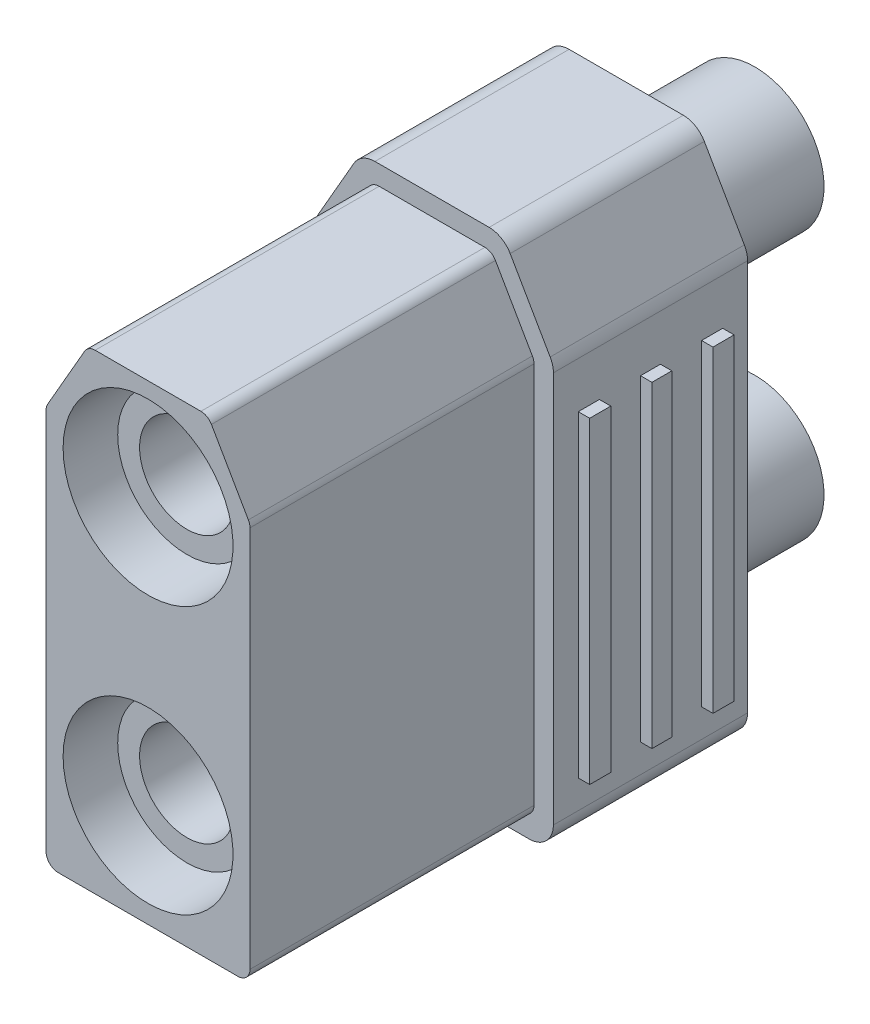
from build123d import *

# Parameters (mm, degrees)
BOSS_EXTRUDE1_DEPTH        = 8
BOSS_EXTRUDE2_DEPTH        = 11.7
SKETCH3_R                  = 3.5
CUT_EXTRUDE1_DEPTH         = 24.75668327
EXTRUDE_THIN1_DEPTH        = 5.3
EXTRUDE_THIN1_DEPTH_BACK   = 18.1
SKETCH4_R                  = 2.85
SKETCH4_R_2                = 1.95
EXTRUDE_THIN1_2_DEPTH      = 5.3
EXTRUDE_THIN1_2_DEPTH_BACK = 18.1
SKETCH5_W                  = 0.82
SKETCH5_H                  = 13.07
SKETCH5_W_2                = 0.87
BOSS_EXTRUDE3_DEPTH        = 0.47
FILLET1_R                  = 1
FILLET2_R                  = 0.5


with BuildPart() as part:
    # Sketch1 → Boss-Extrude1 (new body)
    with BuildSketch(Plane.XY):
        Polygon((-5, 8.7), (-2.931034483, 12.3), (2.931034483, 12.3), (5, 8.7), (5, -8.7), (-5, -8.7), align=None)
    extrude(amount=BOSS_EXTRUDE1_DEPTH)

    # Sketch2 → Boss-Extrude2 (add)
    with BuildSketch(Plane.XY.offset(8)):
        Polygon((-4.2, 8.486489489), (-4.2, -7.9), (4.2, -7.9), (4.2, 8.486489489), (2.468097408, 11.5), (-2.468097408, 11.5), align=None)
    extrude(amount=BOSS_EXTRUDE2_DEPTH)

    # Sketch3 → Cut-Extrude1 (cut, through all)
    with BuildSketch(Plane(origin=(0, 0, 0), x_dir=(-1, 0, 0), z_dir=(0, 0, -1))):
        with Locations((0, -3.65)):
            Circle(SKETCH3_R)
        with Locations((0, 7.35)):
            Circle(SKETCH3_R)
    extrude(amount=-CUT_EXTRUDE1_DEPTH, mode=Mode.SUBTRACT)

    # Sketch5 → Boss-Extrude3 (add)
    with BuildSketch(Plane(origin=(5, 0, 0), x_dir=(0, 0, -1), z_dir=(1, 0, 0))):
        with Locations((-4, 0)):
            Rectangle(SKETCH5_W, SKETCH5_H)
        with Locations((-6.54, 0)):
            Rectangle(SKETCH5_W_2, SKETCH5_H)
        with Locations((-1.46, 0)):
            Rectangle(SKETCH5_W_2, SKETCH5_H)
    boss_extrude3 = extrude(amount=BOSS_EXTRUDE3_DEPTH)

    # Mirror1: Boss-Extrude3 across plane
    add(boss_extrude3.mirror(Plane(origin=(0, 0, 0), x_dir=(0, 0, 1), z_dir=(1, 0, 0))))

    # Fillet1
    fillet1_edges = [part.edges().sort_by_distance(p)[0] for p in [
        (5, -8.7, 4),
        (-5, -8.7, 4),
        (-5, 8.7, 4),
        (-2.931034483, 12.3, 4),
        (2.931034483, 12.3, 4),
        (5, 8.7, 4),
    ]]
    fillet(fillet1_edges, radius=FILLET1_R)

    # Fillet2
    fillet2_edges = [part.edges().sort_by_distance(p)[0] for p in [
        (-2.468097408, 11.5, 13.85),
        (-4.2, 8.486489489, 13.85),
        (-4.2, -7.9, 13.85),
        (4.2, -7.9, 13.85),
        (4.2, 8.486489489, 13.85),
        (2.468097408, 11.5, 13.85),
    ]]
    fillet(fillet2_edges, radius=FILLET2_R)


with BuildPart() as body_2:
    # Sketch4 → Extrude-Thin1 (new, two sides: drawn at the far end of the back side and taken through both)
    with BuildSketch(Plane(origin=(0, 0, 0), x_dir=(-1, 0, 0), z_dir=(0, 0, -1)).offset(-EXTRUDE_THIN1_DEPTH_BACK)):
        with Locations((0, 7.35)):
            Circle(SKETCH4_R)
        with Locations((0, 7.35)):
            Circle(SKETCH4_R_2, mode=Mode.SUBTRACT)
    extrude(amount=EXTRUDE_THIN1_DEPTH + EXTRUDE_THIN1_DEPTH_BACK)


with BuildPart() as body_3:
    # Sketch4 → Extrude-Thin1 2 (new, two sides: drawn at the far end of the back side and taken through both)
    with BuildSketch(Plane(origin=(0, 0, 0), x_dir=(-1, 0, 0), z_dir=(0, 0, -1)).offset(-EXTRUDE_THIN1_2_DEPTH_BACK)):
        with Locations((0, -3.65)):
            Circle(SKETCH4_R)
        with Locations((0, -3.65)):
            Circle(SKETCH4_R_2, mode=Mode.SUBTRACT)
    extrude(amount=EXTRUDE_THIN1_2_DEPTH + EXTRUDE_THIN1_2_DEPTH_BACK)


solid = Compound([part.part, body_2.part, body_3.part])
